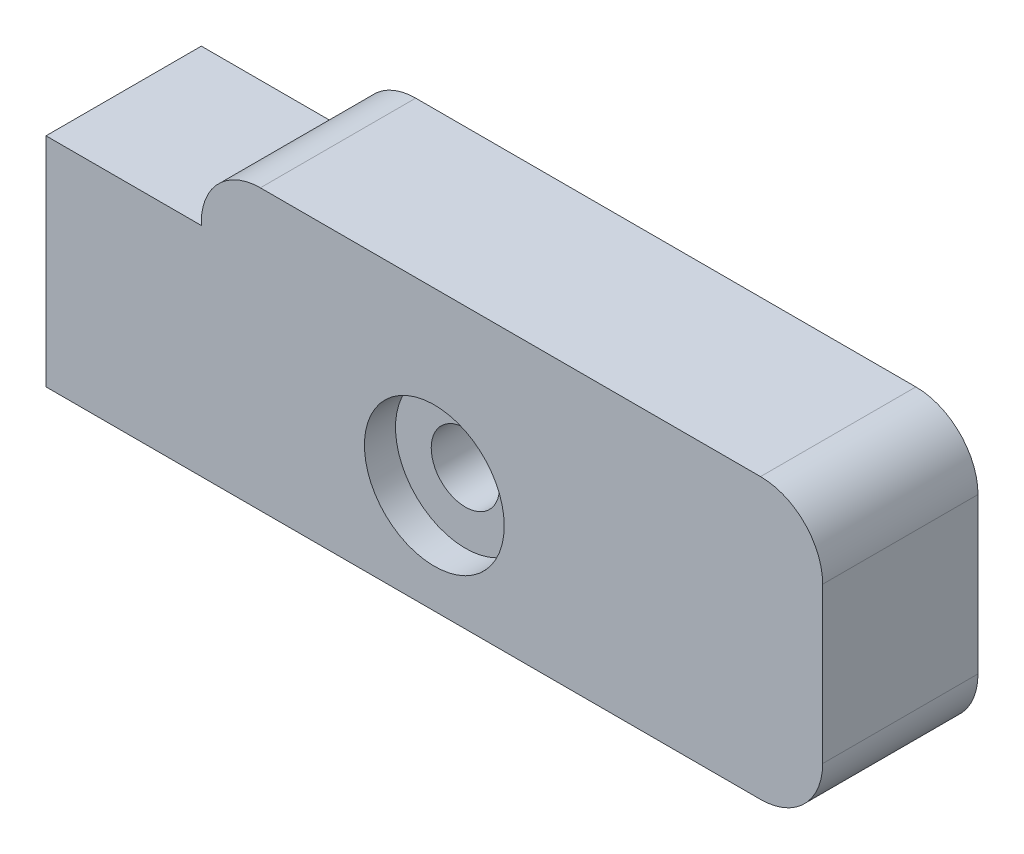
ISO-10303-21;
HEADER;
FILE_DESCRIPTION(('STEP AP214'),'2;1');
FILE_NAME('part.step','',(''),(''),'','','');
FILE_SCHEMA(('AUTOMOTIVE_DESIGN { 1 0 10303 214 1 1 1 1 }'));
ENDSEC;
DATA;
#1=APPLICATION_CONTEXT('core data for automotive mechanical design processes');
#2=APPLICATION_PROTOCOL_DEFINITION('international standard','automotive_design',2000,#1);
#3=PRODUCT_CONTEXT('',#1,'mechanical');
#4=PRODUCT('Part','Part','',(#3));
#5=PRODUCT_RELATED_PRODUCT_CATEGORY('part','',(#4));
#6=PRODUCT_DEFINITION_FORMATION('','',#4);
#7=PRODUCT_DEFINITION_CONTEXT('part definition',#1,'design');
#8=PRODUCT_DEFINITION('design','',#6,#7);
#9=PRODUCT_DEFINITION_SHAPE('','',#8);
#10=(LENGTH_UNIT() NAMED_UNIT(*) SI_UNIT(.MILLI.,.METRE.));
#11=(NAMED_UNIT(*) PLANE_ANGLE_UNIT() SI_UNIT($,.RADIAN.));
#12=(NAMED_UNIT(*) SI_UNIT($,.STERADIAN.) SOLID_ANGLE_UNIT());
#13=UNCERTAINTY_MEASURE_WITH_UNIT(LENGTH_MEASURE(1.E-05),#10,'distance_accuracy_value','');
#14=(GEOMETRIC_REPRESENTATION_CONTEXT(3) GLOBAL_UNCERTAINTY_ASSIGNED_CONTEXT((#13)) GLOBAL_UNIT_ASSIGNED_CONTEXT((#10,
#11,#12)) REPRESENTATION_CONTEXT('',''));
#15=CARTESIAN_POINT('',(0.,0.,0.));
#16=DIRECTION('',(0.,0.,1.));
#17=DIRECTION('',(1.,0.,0.));
#18=AXIS2_PLACEMENT_3D('',#15,#16,#17);
#19=CARTESIAN_POINT('',(12.4996162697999,3.5,10.));
#20=DIRECTION('',(0.,0.,-1.));
#21=DIRECTION('',(-1.,0.,0.));
#22=AXIS2_PLACEMENT_3D('',#19,#20,#21);
#23=CYLINDRICAL_SURFACE('',#22,1.1);
#24=CARTESIAN_POINT('',(12.4996162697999,3.5,0.));
#25=DIRECTION('',(0.,0.,-1.));
#26=DIRECTION('',(-1.,0.,0.));
#27=AXIS2_PLACEMENT_3D('',#24,#25,#26);
#28=CIRCLE('',#27,1.1);
#29=CARTESIAN_POINT('',(11.3996162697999,3.5,0.));
#30=VERTEX_POINT('',#29);
#31=EDGE_CURVE('E243',#30,#30,#28,.T.);
#32=ORIENTED_EDGE('',*,*,#31,.T.);
#33=EDGE_LOOP('',(#32));
#34=FACE_BOUND('',#33,.T.);
#35=CARTESIAN_POINT('',(12.4996162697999,3.5,4.));
#36=DIRECTION('',(0.,0.,1.));
#37=DIRECTION('',(1.,0.,0.));
#38=AXIS2_PLACEMENT_3D('',#35,#36,#37);
#39=CIRCLE('',#38,1.1);
#40=CARTESIAN_POINT('',(13.5996162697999,3.5,4.));
#41=VERTEX_POINT('',#40);
#42=EDGE_CURVE('E38',#41,#41,#39,.F.);
#43=ORIENTED_EDGE('',*,*,#42,.F.);
#44=EDGE_LOOP('',(#43));
#45=FACE_BOUND('',#44,.T.);
#46=ADVANCED_FACE('F34',(#34,#45),#23,.F.);
#47=CARTESIAN_POINT('',(23.,0.,5.));
#48=DIRECTION('',(0.,1.,0.));
#49=DIRECTION('',(-1.,0.,0.));
#50=AXIS2_PLACEMENT_3D('',#47,#48,#49);
#51=PLANE('',#50);
#52=DIRECTION('',(1.,0.,0.));
#53=VECTOR('',#52,1.);
#54=CARTESIAN_POINT('',(23.,0.,0.));
#55=LINE('',#54,#53);
#56=CARTESIAN_POINT('',(0.,0.,0.));
#57=VERTEX_POINT('',#56);
#58=CARTESIAN_POINT('',(23.,0.,0.));
#59=VERTEX_POINT('',#58);
#60=EDGE_CURVE('E151',#57,#59,#55,.T.);
#61=ORIENTED_EDGE('',*,*,#60,.T.);
#62=DIRECTION('',(0.,0.,-1.));
#63=VECTOR('',#62,1.);
#64=CARTESIAN_POINT('',(23.,0.,5.));
#65=LINE('',#64,#63);
#66=CARTESIAN_POINT('',(23.,0.,5.));
#67=VERTEX_POINT('',#66);
#68=EDGE_CURVE('E43',#67,#59,#65,.T.);
#69=ORIENTED_EDGE('',*,*,#68,.F.);
#70=DIRECTION('',(1.,0.,0.));
#71=VECTOR('',#70,1.);
#72=CARTESIAN_POINT('',(23.,0.,5.));
#73=LINE('',#72,#71);
#74=CARTESIAN_POINT('',(0.,0.,5.));
#75=VERTEX_POINT('',#74);
#76=EDGE_CURVE('E169',#75,#67,#73,.T.);
#77=ORIENTED_EDGE('',*,*,#76,.F.);
#78=DIRECTION('',(0.,0.,-1.));
#79=VECTOR('',#78,1.);
#80=CARTESIAN_POINT('',(0.,0.,5.));
#81=LINE('',#80,#79);
#82=EDGE_CURVE('E147',#75,#57,#81,.T.);
#83=ORIENTED_EDGE('',*,*,#82,.T.);
#84=EDGE_LOOP('',(#61,#69,#77,#83));
#85=FACE_BOUND('',#84,.T.);
#86=ADVANCED_FACE('F36',(#85),#51,.F.);
#87=CARTESIAN_POINT('',(23.,2.,5.));
#88=DIRECTION('',(0.,0.,-1.));
#89=DIRECTION('',(-1.,0.,0.));
#90=AXIS2_PLACEMENT_3D('',#87,#88,#89);
#91=CYLINDRICAL_SURFACE('',#90,2.);
#92=CARTESIAN_POINT('',(23.,2.,0.));
#93=DIRECTION('',(0.,0.,1.));
#94=DIRECTION('',(-1.,0.,0.));
#95=AXIS2_PLACEMENT_3D('',#92,#93,#94);
#96=CIRCLE('',#95,2.);
#97=CARTESIAN_POINT('',(25.,2.,0.));
#98=VERTEX_POINT('',#97);
#99=EDGE_CURVE('E154',#59,#98,#96,.T.);
#100=ORIENTED_EDGE('',*,*,#99,.T.);
#101=DIRECTION('',(0.,0.,-1.));
#102=VECTOR('',#101,1.);
#103=CARTESIAN_POINT('',(25.,2.,5.));
#104=LINE('',#103,#102);
#105=CARTESIAN_POINT('',(25.,2.,5.));
#106=VERTEX_POINT('',#105);
#107=EDGE_CURVE('E182',#106,#98,#104,.T.);
#108=ORIENTED_EDGE('',*,*,#107,.F.);
#109=CARTESIAN_POINT('',(23.,2.,5.));
#110=DIRECTION('',(0.,0.,1.));
#111=DIRECTION('',(-1.,0.,0.));
#112=AXIS2_PLACEMENT_3D('',#109,#110,#111);
#113=CIRCLE('',#112,2.);
#114=EDGE_CURVE('E104',#67,#106,#113,.T.);
#115=ORIENTED_EDGE('',*,*,#114,.F.);
#116=ORIENTED_EDGE('',*,*,#68,.T.);
#117=EDGE_LOOP('',(#100,#108,#115,#116));
#118=FACE_BOUND('',#117,.T.);
#119=ADVANCED_FACE('F186',(#118),#91,.T.);
#120=CARTESIAN_POINT('',(25.,7.,5.));
#121=DIRECTION('',(-1.,0.,0.));
#122=DIRECTION('',(0.,0.,1.));
#123=AXIS2_PLACEMENT_3D('',#120,#121,#122);
#124=PLANE('',#123);
#125=DIRECTION('',(0.,1.,0.));
#126=VECTOR('',#125,1.);
#127=CARTESIAN_POINT('',(25.,7.,0.));
#128=LINE('',#127,#126);
#129=CARTESIAN_POINT('',(25.,7.,0.));
#130=VERTEX_POINT('',#129);
#131=EDGE_CURVE('E157',#98,#130,#128,.T.);
#132=ORIENTED_EDGE('',*,*,#131,.T.);
#133=DIRECTION('',(0.,0.,-1.));
#134=VECTOR('',#133,1.);
#135=CARTESIAN_POINT('',(25.,7.,5.));
#136=LINE('',#135,#134);
#137=CARTESIAN_POINT('',(25.,7.,5.));
#138=VERTEX_POINT('',#137);
#139=EDGE_CURVE('E179',#138,#130,#136,.T.);
#140=ORIENTED_EDGE('',*,*,#139,.F.);
#141=DIRECTION('',(0.,1.,0.));
#142=VECTOR('',#141,1.);
#143=CARTESIAN_POINT('',(25.,7.,5.));
#144=LINE('',#143,#142);
#145=EDGE_CURVE('E206',#106,#138,#144,.T.);
#146=ORIENTED_EDGE('',*,*,#145,.F.);
#147=ORIENTED_EDGE('',*,*,#107,.T.);
#148=EDGE_LOOP('',(#132,#140,#146,#147));
#149=FACE_BOUND('',#148,.T.);
#150=ADVANCED_FACE('F197',(#149),#124,.F.);
#151=CARTESIAN_POINT('',(23.,7.,5.));
#152=DIRECTION('',(0.,0.,-1.));
#153=DIRECTION('',(-1.,0.,0.));
#154=AXIS2_PLACEMENT_3D('',#151,#152,#153);
#155=CYLINDRICAL_SURFACE('',#154,2.);
#156=CARTESIAN_POINT('',(23.,7.,0.));
#157=DIRECTION('',(0.,0.,1.));
#158=DIRECTION('',(-1.,0.,0.));
#159=AXIS2_PLACEMENT_3D('',#156,#157,#158);
#160=CIRCLE('',#159,2.);
#161=CARTESIAN_POINT('',(23.,9.,0.));
#162=VERTEX_POINT('',#161);
#163=EDGE_CURVE('E159',#130,#162,#160,.T.);
#164=ORIENTED_EDGE('',*,*,#163,.T.);
#165=DIRECTION('',(0.,0.,-1.));
#166=VECTOR('',#165,1.);
#167=CARTESIAN_POINT('',(23.,9.,5.));
#168=LINE('',#167,#166);
#169=CARTESIAN_POINT('',(23.,9.,5.));
#170=VERTEX_POINT('',#169);
#171=EDGE_CURVE('E176',#170,#162,#168,.T.);
#172=ORIENTED_EDGE('',*,*,#171,.F.);
#173=CARTESIAN_POINT('',(23.,7.,5.));
#174=DIRECTION('',(0.,0.,1.));
#175=DIRECTION('',(-1.,0.,0.));
#176=AXIS2_PLACEMENT_3D('',#173,#174,#175);
#177=CIRCLE('',#176,2.);
#178=EDGE_CURVE('E203',#138,#170,#177,.T.);
#179=ORIENTED_EDGE('',*,*,#178,.F.);
#180=ORIENTED_EDGE('',*,*,#139,.T.);
#181=EDGE_LOOP('',(#164,#172,#179,#180));
#182=FACE_BOUND('',#181,.T.);
#183=ADVANCED_FACE('F201',(#182),#155,.T.);
#184=CARTESIAN_POINT('',(6.90000000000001,9.,5.));
#185=DIRECTION('',(0.,-1.,0.));
#186=DIRECTION('',(0.,0.,-1.));
#187=AXIS2_PLACEMENT_3D('',#184,#185,#186);
#188=PLANE('',#187);
#189=DIRECTION('',(-1.,0.,0.));
#190=VECTOR('',#189,1.);
#191=CARTESIAN_POINT('',(6.90000000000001,9.,0.));
#192=LINE('',#191,#190);
#193=CARTESIAN_POINT('',(6.90000000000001,9.,0.));
#194=VERTEX_POINT('',#193);
#195=EDGE_CURVE('E161',#162,#194,#192,.T.);
#196=ORIENTED_EDGE('',*,*,#195,.T.);
#197=DIRECTION('',(0.,0.,-1.));
#198=VECTOR('',#197,1.);
#199=CARTESIAN_POINT('',(6.90000000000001,9.,5.));
#200=LINE('',#199,#198);
#201=CARTESIAN_POINT('',(6.90000000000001,9.,5.));
#202=VERTEX_POINT('',#201);
#203=EDGE_CURVE('E173',#202,#194,#200,.T.);
#204=ORIENTED_EDGE('',*,*,#203,.F.);
#205=DIRECTION('',(-1.,0.,0.));
#206=VECTOR('',#205,1.);
#207=CARTESIAN_POINT('',(6.90000000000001,9.,5.));
#208=LINE('',#207,#206);
#209=EDGE_CURVE('E205',#170,#202,#208,.T.);
#210=ORIENTED_EDGE('',*,*,#209,.F.);
#211=ORIENTED_EDGE('',*,*,#171,.T.);
#212=EDGE_LOOP('',(#196,#204,#210,#211));
#213=FACE_BOUND('',#212,.T.);
#214=ADVANCED_FACE('F327',(#213),#188,.F.);
#215=CARTESIAN_POINT('',(6.9,7.1,5.));
#216=DIRECTION('',(0.,0.,-1.));
#217=DIRECTION('',(-1.,0.,0.));
#218=AXIS2_PLACEMENT_3D('',#215,#216,#217);
#219=CYLINDRICAL_SURFACE('',#218,1.9);
#220=CARTESIAN_POINT('',(6.9,7.1,0.));
#221=DIRECTION('',(0.,0.,1.));
#222=DIRECTION('',(-1.,0.,0.));
#223=AXIS2_PLACEMENT_3D('',#220,#221,#222);
#224=CIRCLE('',#223,1.9);
#225=CARTESIAN_POINT('',(5.,7.09999999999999,0.));
#226=VERTEX_POINT('',#225);
#227=EDGE_CURVE('E163',#194,#226,#224,.T.);
#228=ORIENTED_EDGE('',*,*,#227,.T.);
#229=DIRECTION('',(0.,0.,-1.));
#230=VECTOR('',#229,1.);
#231=CARTESIAN_POINT('',(5.,7.09999999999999,5.));
#232=LINE('',#231,#230);
#233=CARTESIAN_POINT('',(5.,7.09999999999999,5.));
#234=VERTEX_POINT('',#233);
#235=EDGE_CURVE('E142',#234,#226,#232,.T.);
#236=ORIENTED_EDGE('',*,*,#235,.F.);
#237=CARTESIAN_POINT('',(6.9,7.1,5.));
#238=DIRECTION('',(0.,0.,1.));
#239=DIRECTION('',(-1.,0.,0.));
#240=AXIS2_PLACEMENT_3D('',#237,#238,#239);
#241=CIRCLE('',#240,1.9);
#242=EDGE_CURVE('E130',#202,#234,#241,.T.);
#243=ORIENTED_EDGE('',*,*,#242,.F.);
#244=ORIENTED_EDGE('',*,*,#203,.T.);
#245=EDGE_LOOP('',(#228,#236,#243,#244));
#246=FACE_BOUND('',#245,.T.);
#247=ADVANCED_FACE('F324',(#246),#219,.T.);
#248=CARTESIAN_POINT('',(5.,7.,5.));
#249=DIRECTION('',(1.,0.,0.));
#250=DIRECTION('',(0.,0.,-1.));
#251=AXIS2_PLACEMENT_3D('',#248,#249,#250);
#252=PLANE('',#251);
#253=DIRECTION('',(0.,-1.,0.));
#254=VECTOR('',#253,1.);
#255=CARTESIAN_POINT('',(5.,7.,0.));
#256=LINE('',#255,#254);
#257=CARTESIAN_POINT('',(5.,7.,0.));
#258=VERTEX_POINT('',#257);
#259=EDGE_CURVE('E139',#226,#258,#256,.T.);
#260=ORIENTED_EDGE('',*,*,#259,.T.);
#261=DIRECTION('',(0.,0.,-1.));
#262=VECTOR('',#261,1.);
#263=CARTESIAN_POINT('',(5.,7.,5.));
#264=LINE('',#263,#262);
#265=CARTESIAN_POINT('',(5.,7.,5.));
#266=VERTEX_POINT('',#265);
#267=EDGE_CURVE('E136',#266,#258,#264,.T.);
#268=ORIENTED_EDGE('',*,*,#267,.F.);
#269=DIRECTION('',(0.,-1.,0.));
#270=VECTOR('',#269,1.);
#271=CARTESIAN_POINT('',(5.,7.,5.));
#272=LINE('',#271,#270);
#273=EDGE_CURVE('E123',#234,#266,#272,.T.);
#274=ORIENTED_EDGE('',*,*,#273,.F.);
#275=ORIENTED_EDGE('',*,*,#235,.T.);
#276=EDGE_LOOP('',(#260,#268,#274,#275));
#277=FACE_BOUND('',#276,.T.);
#278=ADVANCED_FACE('F137',(#277),#252,.F.);
#279=CARTESIAN_POINT('',(0.,7.,5.));
#280=DIRECTION('',(0.,-1.,0.));
#281=DIRECTION('',(0.,0.,-1.));
#282=AXIS2_PLACEMENT_3D('',#279,#280,#281);
#283=PLANE('',#282);
#284=DIRECTION('',(-1.,0.,0.));
#285=VECTOR('',#284,1.);
#286=CARTESIAN_POINT('',(0.,7.,0.));
#287=LINE('',#286,#285);
#288=CARTESIAN_POINT('',(0.,7.,0.));
#289=VERTEX_POINT('',#288);
#290=EDGE_CURVE('E166',#258,#289,#287,.T.);
#291=ORIENTED_EDGE('',*,*,#290,.T.);
#292=DIRECTION('',(0.,0.,-1.));
#293=VECTOR('',#292,1.);
#294=CARTESIAN_POINT('',(0.,7.,5.));
#295=LINE('',#294,#293);
#296=CARTESIAN_POINT('',(0.,7.,5.));
#297=VERTEX_POINT('',#296);
#298=EDGE_CURVE('E143',#297,#289,#295,.T.);
#299=ORIENTED_EDGE('',*,*,#298,.F.);
#300=DIRECTION('',(-1.,0.,0.));
#301=VECTOR('',#300,1.);
#302=CARTESIAN_POINT('',(0.,7.,5.));
#303=LINE('',#302,#301);
#304=EDGE_CURVE('E127',#266,#297,#303,.T.);
#305=ORIENTED_EDGE('',*,*,#304,.F.);
#306=ORIENTED_EDGE('',*,*,#267,.T.);
#307=EDGE_LOOP('',(#291,#299,#305,#306));
#308=FACE_BOUND('',#307,.T.);
#309=ADVANCED_FACE('F145',(#308),#283,.F.);
#310=CARTESIAN_POINT('',(0.,0.,5.));
#311=DIRECTION('',(1.,0.,0.));
#312=DIRECTION('',(0.,0.,-1.));
#313=AXIS2_PLACEMENT_3D('',#310,#311,#312);
#314=PLANE('',#313);
#315=DIRECTION('',(0.,0.,1.));
#316=VECTOR('',#315,1.);
#317=CARTESIAN_POINT('',(0.,1.,1.));
#318=LINE('',#317,#316);
#319=CARTESIAN_POINT('',(0.,1.,1.));
#320=VERTEX_POINT('',#319);
#321=CARTESIAN_POINT('',(0.,1.,4.));
#322=VERTEX_POINT('',#321);
#323=EDGE_CURVE('E239',#320,#322,#318,.T.);
#324=ORIENTED_EDGE('',*,*,#323,.F.);
#325=DIRECTION('',(0.,-1.,0.));
#326=VECTOR('',#325,1.);
#327=CARTESIAN_POINT('',(0.,6.,1.));
#328=LINE('',#327,#326);
#329=CARTESIAN_POINT('',(0.,6.,1.));
#330=VERTEX_POINT('',#329);
#331=EDGE_CURVE('E50',#330,#320,#328,.T.);
#332=ORIENTED_EDGE('',*,*,#331,.F.);
#333=DIRECTION('',(0.,0.,-1.));
#334=VECTOR('',#333,1.);
#335=CARTESIAN_POINT('',(0.,6.,1.));
#336=LINE('',#335,#334);
#337=CARTESIAN_POINT('',(0.,6.,4.));
#338=VERTEX_POINT('',#337);
#339=EDGE_CURVE('E232',#338,#330,#336,.T.);
#340=ORIENTED_EDGE('',*,*,#339,.F.);
#341=DIRECTION('',(0.,1.,0.));
#342=VECTOR('',#341,1.);
#343=CARTESIAN_POINT('',(0.,6.,4.));
#344=LINE('',#343,#342);
#345=EDGE_CURVE('E236',#322,#338,#344,.T.);
#346=ORIENTED_EDGE('',*,*,#345,.F.);
#347=EDGE_LOOP('',(#324,#332,#340,#346));
#348=FACE_BOUND('',#347,.T.);
#349=DIRECTION('',(0.,-1.,0.));
#350=VECTOR('',#349,1.);
#351=CARTESIAN_POINT('',(0.,0.,0.));
#352=LINE('',#351,#350);
#353=EDGE_CURVE('E95',#289,#57,#352,.T.);
#354=ORIENTED_EDGE('',*,*,#353,.T.);
#355=ORIENTED_EDGE('',*,*,#82,.F.);
#356=DIRECTION('',(0.,-1.,0.));
#357=VECTOR('',#356,1.);
#358=CARTESIAN_POINT('',(0.,0.,5.));
#359=LINE('',#358,#357);
#360=EDGE_CURVE('E59',#297,#75,#359,.T.);
#361=ORIENTED_EDGE('',*,*,#360,.F.);
#362=ORIENTED_EDGE('',*,*,#298,.T.);
#363=EDGE_LOOP('',(#354,#355,#361,#362));
#364=FACE_BOUND('',#363,.T.);
#365=ADVANCED_FACE('F312',(#348,#364),#314,.F.);
#366=CARTESIAN_POINT('',(6.9,7.1,5.));
#367=DIRECTION('',(0.,0.,-1.));
#368=DIRECTION('',(-1.,0.,0.));
#369=AXIS2_PLACEMENT_3D('',#366,#367,#368);
#370=PLANE('',#369);
#371=CARTESIAN_POINT('',(12.4996162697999,3.5,5.));
#372=DIRECTION('',(0.,0.,1.));
#373=DIRECTION('',(1.,0.,0.));
#374=AXIS2_PLACEMENT_3D('',#371,#372,#373);
#375=CIRCLE('',#374,2.25);
#376=CARTESIAN_POINT('',(14.7496162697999,3.5,5.));
#377=VERTEX_POINT('',#376);
#378=EDGE_CURVE('E256',#377,#377,#375,.T.);
#379=ORIENTED_EDGE('',*,*,#378,.F.);
#380=EDGE_LOOP('',(#379));
#381=FACE_BOUND('',#380,.T.);
#382=ORIENTED_EDGE('',*,*,#76,.T.);
#383=ORIENTED_EDGE('',*,*,#114,.T.);
#384=ORIENTED_EDGE('',*,*,#145,.T.);
#385=ORIENTED_EDGE('',*,*,#178,.T.);
#386=ORIENTED_EDGE('',*,*,#209,.T.);
#387=ORIENTED_EDGE('',*,*,#242,.T.);
#388=ORIENTED_EDGE('',*,*,#273,.T.);
#389=ORIENTED_EDGE('',*,*,#304,.T.);
#390=ORIENTED_EDGE('',*,*,#360,.T.);
#391=EDGE_LOOP('',(#382,#383,#384,#385,#386,#387,#388,#389,#390));
#392=FACE_BOUND('',#391,.T.);
#393=ADVANCED_FACE('F125',(#381,#392),#370,.F.);
#394=CARTESIAN_POINT('',(6.9,7.1,0.));
#395=DIRECTION('',(0.,0.,-1.));
#396=DIRECTION('',(-1.,0.,0.));
#397=AXIS2_PLACEMENT_3D('',#394,#395,#396);
#398=PLANE('',#397);
#399=CARTESIAN_POINT('',(12.4996162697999,3.5,0.));
#400=DIRECTION('',(0.,0.,-1.));
#401=DIRECTION('',(-1.,0.,0.));
#402=AXIS2_PLACEMENT_3D('',#399,#400,#401);
#403=CIRCLE('',#402,3.);
#404=CARTESIAN_POINT('',(9.49961626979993,3.5,0.));
#405=VERTEX_POINT('',#404);
#406=EDGE_CURVE('E213',#405,#405,#403,.T.);
#407=ORIENTED_EDGE('',*,*,#406,.F.);
#408=EDGE_LOOP('',(#407));
#409=FACE_BOUND('',#408,.T.);
#410=ORIENTED_EDGE('',*,*,#60,.F.);
#411=ORIENTED_EDGE('',*,*,#353,.F.);
#412=ORIENTED_EDGE('',*,*,#290,.F.);
#413=ORIENTED_EDGE('',*,*,#259,.F.);
#414=ORIENTED_EDGE('',*,*,#227,.F.);
#415=ORIENTED_EDGE('',*,*,#195,.F.);
#416=ORIENTED_EDGE('',*,*,#163,.F.);
#417=ORIENTED_EDGE('',*,*,#131,.F.);
#418=ORIENTED_EDGE('',*,*,#99,.F.);
#419=EDGE_LOOP('',(#410,#411,#412,#413,#414,#415,#416,#417,#418));
#420=FACE_BOUND('',#419,.T.);
#421=ADVANCED_FACE('F191',(#409,#420),#398,.T.);
#422=CARTESIAN_POINT('',(12.4996162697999,3.5,-2.5));
#423=DIRECTION('',(0.,0.,-1.));
#424=DIRECTION('',(-1.,0.,0.));
#425=AXIS2_PLACEMENT_3D('',#422,#423,#424);
#426=PLANE('',#425);
#427=CARTESIAN_POINT('',(12.4996162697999,3.5,-2.5));
#428=DIRECTION('',(0.,0.,-1.));
#429=DIRECTION('',(-1.,0.,0.));
#430=AXIS2_PLACEMENT_3D('',#427,#428,#429);
#431=CIRCLE('',#430,3.);
#432=CARTESIAN_POINT('',(9.49961626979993,3.5,-2.5));
#433=VERTEX_POINT('',#432);
#434=EDGE_CURVE('E155',#433,#433,#431,.T.);
#435=ORIENTED_EDGE('',*,*,#434,.T.);
#436=EDGE_LOOP('',(#435));
#437=FACE_BOUND('',#436,.T.);
#438=CARTESIAN_POINT('',(12.4996162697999,3.5,-2.5));
#439=DIRECTION('',(0.,0.,-1.));
#440=DIRECTION('',(-1.,0.,0.));
#441=AXIS2_PLACEMENT_3D('',#438,#439,#440);
#442=CIRCLE('',#441,2.1);
#443=CARTESIAN_POINT('',(10.3996162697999,3.5,-2.5));
#444=VERTEX_POINT('',#443);
#445=EDGE_CURVE('E216',#444,#444,#442,.T.);
#446=ORIENTED_EDGE('',*,*,#445,.F.);
#447=EDGE_LOOP('',(#446));
#448=FACE_BOUND('',#447,.T.);
#449=ADVANCED_FACE('F303',(#437,#448),#426,.T.);
#450=CARTESIAN_POINT('',(12.4996162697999,3.5,-2.5));
#451=DIRECTION('',(0.,0.,1.));
#452=DIRECTION('',(1.,0.,0.));
#453=AXIS2_PLACEMENT_3D('',#450,#451,#452);
#454=CYLINDRICAL_SURFACE('',#453,3.);
#455=ORIENTED_EDGE('',*,*,#434,.F.);
#456=EDGE_LOOP('',(#455));
#457=FACE_BOUND('',#456,.T.);
#458=ORIENTED_EDGE('',*,*,#406,.T.);
#459=EDGE_LOOP('',(#458));
#460=FACE_BOUND('',#459,.T.);
#461=ADVANCED_FACE('F301',(#457,#460),#454,.T.);
#462=CARTESIAN_POINT('',(12.4996162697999,3.5,-2.5));
#463=DIRECTION('',(0.,0.,1.));
#464=DIRECTION('',(1.,0.,0.));
#465=AXIS2_PLACEMENT_3D('',#462,#463,#464);
#466=CYLINDRICAL_SURFACE('',#465,2.1);
#467=ORIENTED_EDGE('',*,*,#445,.T.);
#468=EDGE_LOOP('',(#467));
#469=FACE_BOUND('',#468,.T.);
#470=CARTESIAN_POINT('',(12.4996162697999,3.5,0.));
#471=DIRECTION('',(0.,0.,-1.));
#472=DIRECTION('',(-1.,0.,0.));
#473=AXIS2_PLACEMENT_3D('',#470,#471,#472);
#474=CIRCLE('',#473,2.1);
#475=CARTESIAN_POINT('',(10.3996162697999,3.5,0.));
#476=VERTEX_POINT('',#475);
#477=EDGE_CURVE('E11',#476,#476,#474,.F.);
#478=ORIENTED_EDGE('',*,*,#477,.T.);
#479=EDGE_LOOP('',(#478));
#480=FACE_BOUND('',#479,.T.);
#481=ADVANCED_FACE('F298',(#469,#480),#466,.F.);
#482=ORIENTED_EDGE('',*,*,#31,.F.);
#483=EDGE_LOOP('',(#482));
#484=FACE_BOUND('',#483,.T.);
#485=ORIENTED_EDGE('',*,*,#477,.F.);
#486=EDGE_LOOP('',(#485));
#487=FACE_BOUND('',#486,.T.);
#488=ADVANCED_FACE('F297',(#484,#487),#398,.T.);
#489=CARTESIAN_POINT('',(9.,6.,1.));
#490=DIRECTION('',(0.,0.,-1.));
#491=DIRECTION('',(0.,1.,0.));
#492=AXIS2_PLACEMENT_3D('',#489,#490,#491);
#493=PLANE('',#492);
#494=ORIENTED_EDGE('',*,*,#331,.T.);
#495=DIRECTION('',(-1.,0.,0.));
#496=VECTOR('',#495,1.);
#497=CARTESIAN_POINT('',(9.,1.,1.));
#498=LINE('',#497,#496);
#499=CARTESIAN_POINT('',(9.,1.,1.));
#500=VERTEX_POINT('',#499);
#501=EDGE_CURVE('E222',#500,#320,#498,.T.);
#502=ORIENTED_EDGE('',*,*,#501,.F.);
#503=DIRECTION('',(0.,-1.,0.));
#504=VECTOR('',#503,1.);
#505=CARTESIAN_POINT('',(9.,6.,1.));
#506=LINE('',#505,#504);
#507=CARTESIAN_POINT('',(9.,6.,1.));
#508=VERTEX_POINT('',#507);
#509=EDGE_CURVE('E235',#508,#500,#506,.T.);
#510=ORIENTED_EDGE('',*,*,#509,.F.);
#511=DIRECTION('',(-1.,0.,0.));
#512=VECTOR('',#511,1.);
#513=CARTESIAN_POINT('',(9.,6.,1.));
#514=LINE('',#513,#512);
#515=EDGE_CURVE('E221',#508,#330,#514,.T.);
#516=ORIENTED_EDGE('',*,*,#515,.T.);
#517=EDGE_LOOP('',(#494,#502,#510,#516));
#518=FACE_BOUND('',#517,.T.);
#519=ADVANCED_FACE('F287',(#518),#493,.F.);
#520=CARTESIAN_POINT('',(9.,6.,1.));
#521=DIRECTION('',(0.,1.,0.));
#522=DIRECTION('',(0.,0.,1.));
#523=AXIS2_PLACEMENT_3D('',#520,#521,#522);
#524=PLANE('',#523);
#525=ORIENTED_EDGE('',*,*,#339,.T.);
#526=ORIENTED_EDGE('',*,*,#515,.F.);
#527=DIRECTION('',(0.,0.,-1.));
#528=VECTOR('',#527,1.);
#529=CARTESIAN_POINT('',(9.,6.,1.));
#530=LINE('',#529,#528);
#531=CARTESIAN_POINT('',(9.,6.,4.));
#532=VERTEX_POINT('',#531);
#533=EDGE_CURVE('E225',#532,#508,#530,.T.);
#534=ORIENTED_EDGE('',*,*,#533,.F.);
#535=DIRECTION('',(-1.,0.,0.));
#536=VECTOR('',#535,1.);
#537=CARTESIAN_POINT('',(9.,6.,4.));
#538=LINE('',#537,#536);
#539=EDGE_CURVE('E228',#532,#338,#538,.T.);
#540=ORIENTED_EDGE('',*,*,#539,.T.);
#541=EDGE_LOOP('',(#525,#526,#534,#540));
#542=FACE_BOUND('',#541,.T.);
#543=ADVANCED_FACE('F283',(#542),#524,.F.);
#544=CARTESIAN_POINT('',(9.,6.,4.));
#545=DIRECTION('',(0.,0.,1.));
#546=DIRECTION('',(0.,-1.,0.));
#547=AXIS2_PLACEMENT_3D('',#544,#545,#546);
#548=PLANE('',#547);
#549=ORIENTED_EDGE('',*,*,#345,.T.);
#550=ORIENTED_EDGE('',*,*,#539,.F.);
#551=DIRECTION('',(0.,1.,0.));
#552=VECTOR('',#551,1.);
#553=CARTESIAN_POINT('',(9.,6.,4.));
#554=LINE('',#553,#552);
#555=CARTESIAN_POINT('',(9.,1.,4.));
#556=VERTEX_POINT('',#555);
#557=EDGE_CURVE('E246',#556,#532,#554,.T.);
#558=ORIENTED_EDGE('',*,*,#557,.F.);
#559=DIRECTION('',(-1.,0.,0.));
#560=VECTOR('',#559,1.);
#561=CARTESIAN_POINT('',(9.,1.,4.));
#562=LINE('',#561,#560);
#563=EDGE_CURVE('E224',#556,#322,#562,.T.);
#564=ORIENTED_EDGE('',*,*,#563,.T.);
#565=EDGE_LOOP('',(#549,#550,#558,#564));
#566=FACE_BOUND('',#565,.T.);
#567=ADVANCED_FACE('F286',(#566),#548,.F.);
#568=CARTESIAN_POINT('',(9.,1.,1.));
#569=DIRECTION('',(0.,-1.,0.));
#570=DIRECTION('',(0.,0.,-1.));
#571=AXIS2_PLACEMENT_3D('',#568,#569,#570);
#572=PLANE('',#571);
#573=ORIENTED_EDGE('',*,*,#323,.T.);
#574=ORIENTED_EDGE('',*,*,#563,.F.);
#575=DIRECTION('',(0.,0.,1.));
#576=VECTOR('',#575,1.);
#577=CARTESIAN_POINT('',(9.,1.,1.));
#578=LINE('',#577,#576);
#579=EDGE_CURVE('E249',#500,#556,#578,.T.);
#580=ORIENTED_EDGE('',*,*,#579,.F.);
#581=ORIENTED_EDGE('',*,*,#501,.T.);
#582=EDGE_LOOP('',(#573,#574,#580,#581));
#583=FACE_BOUND('',#582,.T.);
#584=ADVANCED_FACE('F281',(#583),#572,.F.);
#585=CARTESIAN_POINT('',(9.,0.,0.));
#586=DIRECTION('',(-1.,0.,0.));
#587=DIRECTION('',(0.,0.,1.));
#588=AXIS2_PLACEMENT_3D('',#585,#586,#587);
#589=PLANE('',#588);
#590=ORIENTED_EDGE('',*,*,#509,.T.);
#591=ORIENTED_EDGE('',*,*,#579,.T.);
#592=ORIENTED_EDGE('',*,*,#557,.T.);
#593=ORIENTED_EDGE('',*,*,#533,.T.);
#594=EDGE_LOOP('',(#590,#591,#592,#593));
#595=FACE_BOUND('',#594,.T.);
#596=ADVANCED_FACE('F278',(#595),#589,.T.);
#597=CARTESIAN_POINT('',(12.4996162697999,3.5,4.));
#598=DIRECTION('',(0.,0.,1.));
#599=DIRECTION('',(1.,0.,0.));
#600=AXIS2_PLACEMENT_3D('',#597,#598,#599);
#601=PLANE('',#600);
#602=CARTESIAN_POINT('',(12.4996162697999,3.5,4.));
#603=DIRECTION('',(0.,0.,1.));
#604=DIRECTION('',(1.,0.,0.));
#605=AXIS2_PLACEMENT_3D('',#602,#603,#604);
#606=CIRCLE('',#605,2.25);
#607=CARTESIAN_POINT('',(14.7496162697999,3.5,4.));
#608=VERTEX_POINT('',#607);
#609=EDGE_CURVE('E259',#608,#608,#606,.T.);
#610=ORIENTED_EDGE('',*,*,#609,.T.);
#611=EDGE_LOOP('',(#610));
#612=FACE_BOUND('',#611,.T.);
#613=ORIENTED_EDGE('',*,*,#42,.T.);
#614=EDGE_LOOP('',(#613));
#615=FACE_BOUND('',#614,.T.);
#616=ADVANCED_FACE('F266',(#612,#615),#601,.T.);
#617=CARTESIAN_POINT('',(12.4996162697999,3.5,4.));
#618=DIRECTION('',(0.,0.,1.));
#619=DIRECTION('',(1.,0.,0.));
#620=AXIS2_PLACEMENT_3D('',#617,#618,#619);
#621=CYLINDRICAL_SURFACE('',#620,2.25);
#622=ORIENTED_EDGE('',*,*,#609,.F.);
#623=EDGE_LOOP('',(#622));
#624=FACE_BOUND('',#623,.T.);
#625=ORIENTED_EDGE('',*,*,#378,.T.);
#626=EDGE_LOOP('',(#625));
#627=FACE_BOUND('',#626,.T.);
#628=ADVANCED_FACE('F276',(#624,#627),#621,.F.);
#629=CLOSED_SHELL('',(#46,#86,#119,#150,#183,#214,#247,#278,#309,#365,#393,#421,#449,#461,#481,
#488,#519,#543,#567,#584,#596,#616,#628));
#630=MANIFOLD_SOLID_BREP('B2',#629);
#631=ADVANCED_BREP_SHAPE_REPRESENTATION('',(#18,#630),#14);
#632=SHAPE_DEFINITION_REPRESENTATION(#9,#631);
ENDSEC;
END-ISO-10303-21;
